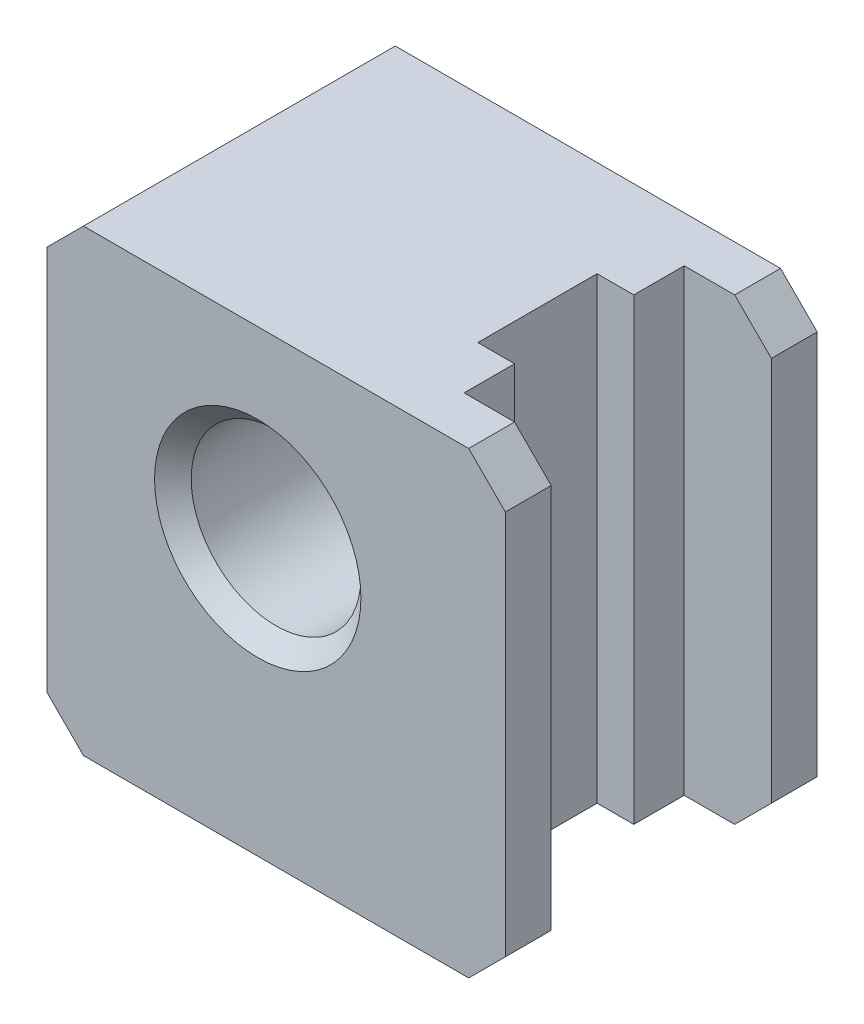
from build123d import *

# Parameters (mm, degrees)
ESQUISSE1_W                       = 50
ESQUISSE1_H                       = 50
EXTRUSION1_DEPTH                  = 17
DIAM_TRE_DU_PER_AGE_18_5_18_5_2_D = 18.5
CHANFREIN1_SIZE                   = 2
CHANFREIN2_SIZE                   = 4
ESQUISSE5_W                       = 24
ESQUISSE5_H                       = 50
EXTRUSION2_DEPTH                  = 9.5
ESQUISSE6_W                       = 13
ESQUISSE6_H                       = 50
EXTRUSION3_DEPTH                  = 4


with BuildPart() as part:
    # Esquisse1 → Extrusion1 (new, symmetric)
    with BuildSketch(Plane.XY):
        Rectangle(ESQUISSE1_W, ESQUISSE1_H)
    extrude(amount=EXTRUSION1_DEPTH, both=True)

    # Diam_tre du per_age _18.5 _18.5_2 (through all)
    with Locations(Plane.XY.offset(17)):
        with Locations((-2, 5)):
            Hole(DIAM_TRE_DU_PER_AGE_18_5_18_5_2_D / 2)

    # Chanfrein1
    chanfrein1_edges = [part.edges().sort_by_distance(p)[0] for p in [
        (7.25, 5, 17),
        (7.25, 5, -17),
    ]]
    chamfer(chanfrein1_edges, length=CHANFREIN1_SIZE)

    # Chanfrein2
    chanfrein2_edges = [part.edges().sort_by_distance(p)[0] for p in [
        (-25, 25, 0),
        (25, 25, 0),
        (25, -25, 0),
        (-25, -25, 0),
    ]]
    chamfer(chanfrein2_edges, length=CHANFREIN2_SIZE)

    # Esquisse5 → Extrusion2 (cut)
    with BuildSketch(Plane(origin=(25, 0, 0), x_dir=(0, 0, -1), z_dir=(1, 0, 0))):
        Rectangle(ESQUISSE5_W, ESQUISSE5_H)
    extrude(amount=-EXTRUSION2_DEPTH, mode=Mode.SUBTRACT)

    # Esquisse6 → Extrusion3 (cut)
    with BuildSketch(Plane(origin=(15.5, 0, 0), x_dir=(0, 0, -1), z_dir=(1, 0, 0))):
        Rectangle(ESQUISSE6_W, ESQUISSE6_H)
    extrude(amount=-EXTRUSION3_DEPTH, mode=Mode.SUBTRACT)


solid = part.part
